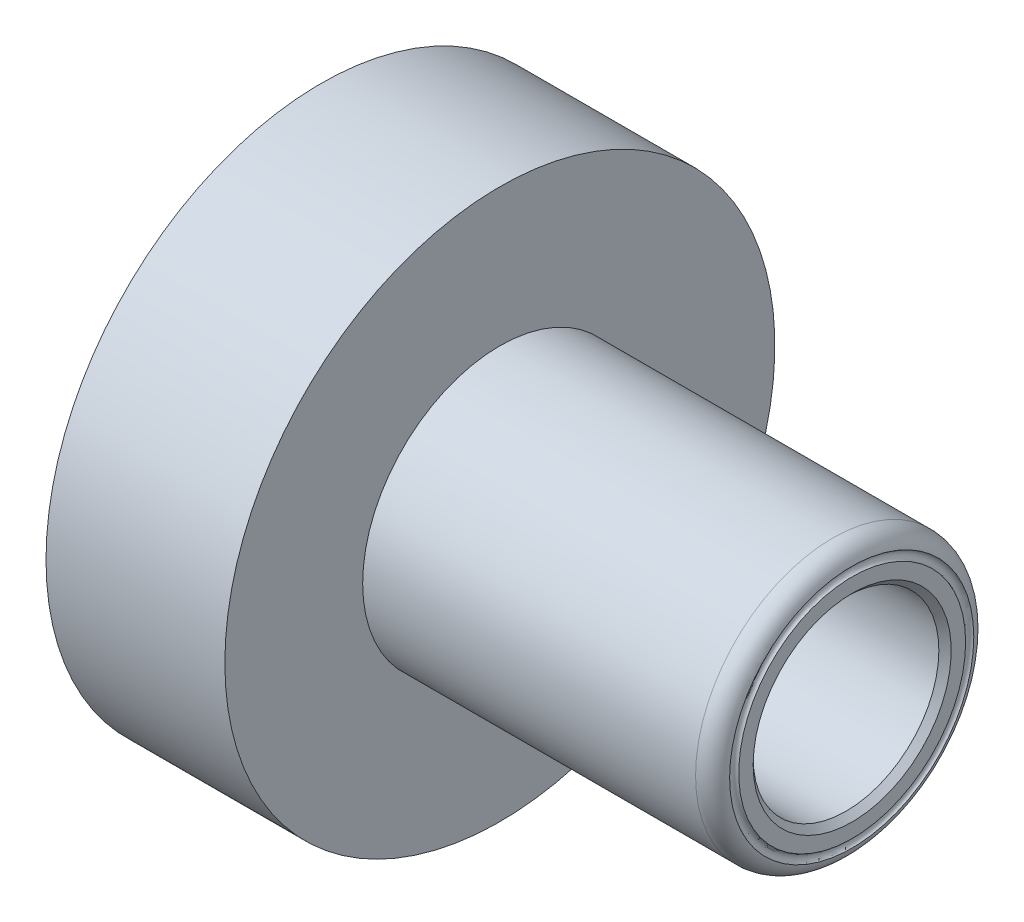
ISO-10303-21;
HEADER;
FILE_DESCRIPTION(('STEP AP214'),'2;1');
FILE_NAME('part.step','',(''),(''),'','','');
FILE_SCHEMA(('AUTOMOTIVE_DESIGN { 1 0 10303 214 1 1 1 1 }'));
ENDSEC;
DATA;
#1=APPLICATION_CONTEXT('core data for automotive mechanical design processes');
#2=APPLICATION_PROTOCOL_DEFINITION('international standard','automotive_design',2000,#1);
#3=PRODUCT_CONTEXT('',#1,'mechanical');
#4=PRODUCT('Part','Part','',(#3));
#5=PRODUCT_RELATED_PRODUCT_CATEGORY('part','',(#4));
#6=PRODUCT_DEFINITION_FORMATION('','',#4);
#7=PRODUCT_DEFINITION_CONTEXT('part definition',#1,'design');
#8=PRODUCT_DEFINITION('design','',#6,#7);
#9=PRODUCT_DEFINITION_SHAPE('','',#8);
#10=(LENGTH_UNIT() NAMED_UNIT(*) SI_UNIT(.MILLI.,.METRE.));
#11=(NAMED_UNIT(*) PLANE_ANGLE_UNIT() SI_UNIT($,.RADIAN.));
#12=(NAMED_UNIT(*) SI_UNIT($,.STERADIAN.) SOLID_ANGLE_UNIT());
#13=UNCERTAINTY_MEASURE_WITH_UNIT(LENGTH_MEASURE(1.E-05),#10,'distance_accuracy_value','');
#14=(GEOMETRIC_REPRESENTATION_CONTEXT(3) GLOBAL_UNCERTAINTY_ASSIGNED_CONTEXT((#13)) GLOBAL_UNIT_ASSIGNED_CONTEXT((#10,
#11,#12)) REPRESENTATION_CONTEXT('',''));
#15=CARTESIAN_POINT('',(0.,0.,0.));
#16=DIRECTION('',(0.,0.,1.));
#17=DIRECTION('',(1.,0.,0.));
#18=AXIS2_PLACEMENT_3D('',#15,#16,#17);
#19=CARTESIAN_POINT('',(42.926,9.5171,0.));
#20=DIRECTION('',(-1.,0.,0.));
#21=DIRECTION('',(0.,0.,1.));
#22=AXIS2_PLACEMENT_3D('',#19,#20,#21);
#23=PLANE('',#22);
#24=CARTESIAN_POINT('',(42.926,0.,0.));
#25=DIRECTION('',(-1.,0.,0.));
#26=DIRECTION('',(0.,0.,1.));
#27=AXIS2_PLACEMENT_3D('',#24,#25,#26);
#28=CIRCLE('',#27,8.005);
#29=CARTESIAN_POINT('',(42.926,0.,8.005));
#30=VERTEX_POINT('',#29);
#31=EDGE_CURVE('E10',#30,#30,#28,.T.);
#32=ORIENTED_EDGE('',*,*,#31,.T.);
#33=EDGE_LOOP('',(#32));
#34=FACE_BOUND('',#33,.T.);
#35=CARTESIAN_POINT('',(42.926,0.,0.));
#36=DIRECTION('',(1.,0.,0.));
#37=DIRECTION('',(0.,0.,-1.));
#38=AXIS2_PLACEMENT_3D('',#35,#36,#37);
#39=CIRCLE('',#38,9.16722912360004);
#40=CARTESIAN_POINT('',(42.926,0.,-9.16722912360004));
#41=VERTEX_POINT('',#40);
#42=EDGE_CURVE('E78',#41,#41,#39,.F.);
#43=ORIENTED_EDGE('',*,*,#42,.F.);
#44=EDGE_LOOP('',(#43));
#45=FACE_BOUND('',#44,.T.);
#46=ADVANCED_FACE('F31',(#34,#45),#23,.F.);
#47=CARTESIAN_POINT('',(41.356,0.,0.));
#48=DIRECTION('',(-1.,0.,0.));
#49=DIRECTION('',(0.,0.,1.));
#50=AXIS2_PLACEMENT_3D('',#47,#48,#49);
#51=TOROIDAL_SURFACE('',#50,9.5171,1.57);
#52=CARTESIAN_POINT('',(41.356,0.,0.));
#53=DIRECTION('',(-1.,0.,0.));
#54=DIRECTION('',(0.,0.,1.));
#55=AXIS2_PLACEMENT_3D('',#52,#53,#54);
#56=CIRCLE('',#55,11.0871);
#57=CARTESIAN_POINT('',(41.356,0.,11.0871));
#58=VERTEX_POINT('',#57);
#59=EDGE_CURVE('E48',#58,#58,#56,.T.);
#60=ORIENTED_EDGE('',*,*,#59,.F.);
#61=EDGE_LOOP('',(#60));
#62=FACE_BOUND('',#61,.T.);
#63=CARTESIAN_POINT('',(42.886773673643,0.,0.));
#64=DIRECTION('',(1.,0.,0.));
#65=DIRECTION('',(0.,0.,-1.));
#66=AXIS2_PLACEMENT_3D('',#63,#64,#65);
#67=CIRCLE('',#66,9.86585773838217);
#68=CARTESIAN_POINT('',(42.886773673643,0.,-9.86585773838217));
#69=VERTEX_POINT('',#68);
#70=EDGE_CURVE('E35',#69,#69,#67,.T.);
#71=ORIENTED_EDGE('',*,*,#70,.F.);
#72=EDGE_LOOP('',(#71));
#73=FACE_BOUND('',#72,.T.);
#74=ADVANCED_FACE('F87',(#62,#73),#51,.T.);
#75=CARTESIAN_POINT('',(0.,0.,0.));
#76=DIRECTION('',(-1.,0.,0.));
#77=DIRECTION('',(0.,0.,1.));
#78=AXIS2_PLACEMENT_3D('',#75,#76,#77);
#79=CYLINDRICAL_SURFACE('',#78,8.128);
#80=CARTESIAN_POINT('',(28.067,0.,0.));
#81=DIRECTION('',(-1.,0.,0.));
#82=DIRECTION('',(0.,0.,1.));
#83=AXIS2_PLACEMENT_3D('',#80,#81,#82);
#84=CIRCLE('',#83,8.128);
#85=CARTESIAN_POINT('',(28.067,0.,8.128));
#86=VERTEX_POINT('',#85);
#87=EDGE_CURVE('E43',#86,#86,#84,.T.);
#88=ORIENTED_EDGE('',*,*,#87,.F.);
#89=EDGE_LOOP('',(#88));
#90=FACE_BOUND('',#89,.T.);
#91=CARTESIAN_POINT('',(0.,0.,0.));
#92=DIRECTION('',(-1.,0.,0.));
#93=DIRECTION('',(0.,0.,1.));
#94=AXIS2_PLACEMENT_3D('',#91,#92,#93);
#95=CIRCLE('',#94,8.128);
#96=CARTESIAN_POINT('',(0.,0.,8.128));
#97=VERTEX_POINT('',#96);
#98=EDGE_CURVE('E60',#97,#97,#95,.T.);
#99=ORIENTED_EDGE('',*,*,#98,.T.);
#100=EDGE_LOOP('',(#99));
#101=FACE_BOUND('',#100,.T.);
#102=ADVANCED_FACE('F89',(#90,#101),#79,.F.);
#103=CARTESIAN_POINT('',(28.067,8.128,0.));
#104=DIRECTION('',(1.,0.,0.));
#105=DIRECTION('',(0.,0.,-1.));
#106=AXIS2_PLACEMENT_3D('',#103,#104,#105);
#107=PLANE('',#106);
#108=CARTESIAN_POINT('',(28.067,0.,0.));
#109=DIRECTION('',(1.,0.,0.));
#110=DIRECTION('',(0.,0.,-1.));
#111=AXIS2_PLACEMENT_3D('',#108,#109,#110);
#112=CIRCLE('',#111,7.505);
#113=CARTESIAN_POINT('',(28.067,0.,-7.505));
#114=VERTEX_POINT('',#113);
#115=EDGE_CURVE('E73',#114,#114,#112,.T.);
#116=ORIENTED_EDGE('',*,*,#115,.T.);
#117=EDGE_LOOP('',(#116));
#118=FACE_BOUND('',#117,.T.);
#119=ORIENTED_EDGE('',*,*,#87,.T.);
#120=EDGE_LOOP('',(#119));
#121=FACE_BOUND('',#120,.T.);
#122=ADVANCED_FACE('F96',(#118,#121),#107,.F.);
#123=CARTESIAN_POINT('',(0.,0.,0.));
#124=DIRECTION('',(-1.,0.,0.));
#125=DIRECTION('',(0.,0.,1.));
#126=AXIS2_PLACEMENT_3D('',#123,#124,#125);
#127=CYLINDRICAL_SURFACE('',#126,11.0871);
#128=CARTESIAN_POINT('',(14.4526,0.,0.));
#129=DIRECTION('',(-1.,0.,0.));
#130=DIRECTION('',(0.,0.,1.));
#131=AXIS2_PLACEMENT_3D('',#128,#129,#130);
#132=CIRCLE('',#131,11.0871);
#133=CARTESIAN_POINT('',(14.4526,0.,11.0871));
#134=VERTEX_POINT('',#133);
#135=EDGE_CURVE('E51',#134,#134,#132,.T.);
#136=ORIENTED_EDGE('',*,*,#135,.F.);
#137=EDGE_LOOP('',(#136));
#138=FACE_BOUND('',#137,.T.);
#139=ORIENTED_EDGE('',*,*,#59,.T.);
#140=EDGE_LOOP('',(#139));
#141=FACE_BOUND('',#140,.T.);
#142=ADVANCED_FACE('F101',(#138,#141),#127,.T.);
#143=CARTESIAN_POINT('',(14.4526,22.225,0.));
#144=DIRECTION('',(-1.,0.,0.));
#145=DIRECTION('',(0.,0.,1.));
#146=AXIS2_PLACEMENT_3D('',#143,#144,#145);
#147=PLANE('',#146);
#148=CARTESIAN_POINT('',(14.4526,0.,0.));
#149=DIRECTION('',(-1.,0.,0.));
#150=DIRECTION('',(0.,0.,1.));
#151=AXIS2_PLACEMENT_3D('',#148,#149,#150);
#152=CIRCLE('',#151,22.225);
#153=CARTESIAN_POINT('',(14.4526,0.,22.225));
#154=VERTEX_POINT('',#153);
#155=EDGE_CURVE('E54',#154,#154,#152,.T.);
#156=ORIENTED_EDGE('',*,*,#155,.F.);
#157=EDGE_LOOP('',(#156));
#158=FACE_BOUND('',#157,.T.);
#159=ORIENTED_EDGE('',*,*,#135,.T.);
#160=EDGE_LOOP('',(#159));
#161=FACE_BOUND('',#160,.T.);
#162=ADVANCED_FACE('F109',(#158,#161),#147,.F.);
#163=CARTESIAN_POINT('',(0.,0.,0.));
#164=DIRECTION('',(-1.,0.,0.));
#165=DIRECTION('',(0.,0.,1.));
#166=AXIS2_PLACEMENT_3D('',#163,#164,#165);
#167=CYLINDRICAL_SURFACE('',#166,22.225);
#168=CARTESIAN_POINT('',(0.,0.,0.));
#169=DIRECTION('',(-1.,0.,0.));
#170=DIRECTION('',(0.,0.,1.));
#171=AXIS2_PLACEMENT_3D('',#168,#169,#170);
#172=CIRCLE('',#171,22.225);
#173=CARTESIAN_POINT('',(0.,0.,22.225));
#174=VERTEX_POINT('',#173);
#175=EDGE_CURVE('E57',#174,#174,#172,.T.);
#176=ORIENTED_EDGE('',*,*,#175,.F.);
#177=EDGE_LOOP('',(#176));
#178=FACE_BOUND('',#177,.T.);
#179=ORIENTED_EDGE('',*,*,#155,.T.);
#180=EDGE_LOOP('',(#179));
#181=FACE_BOUND('',#180,.T.);
#182=ADVANCED_FACE('F121',(#178,#181),#167,.T.);
#183=CARTESIAN_POINT('',(0.,8.128,0.));
#184=DIRECTION('',(1.,0.,0.));
#185=DIRECTION('',(0.,0.,-1.));
#186=AXIS2_PLACEMENT_3D('',#183,#184,#185);
#187=PLANE('',#186);
#188=CARTESIAN_POINT('',(0.,0.,12.7));
#189=DIRECTION('',(-1.,0.,0.));
#190=DIRECTION('',(0.,0.,-1.));
#191=AXIS2_PLACEMENT_3D('',#188,#189,#190);
#192=CIRCLE('',#191,3.2004);
#193=CARTESIAN_POINT('',(0.,0.,9.4996));
#194=VERTEX_POINT('',#193);
#195=EDGE_CURVE('E70',#194,#194,#192,.T.);
#196=ORIENTED_EDGE('',*,*,#195,.F.);
#197=EDGE_LOOP('',(#196));
#198=FACE_BOUND('',#197,.T.);
#199=CARTESIAN_POINT('',(0.,0.,-12.7));
#200=DIRECTION('',(-1.,0.,0.));
#201=DIRECTION('',(0.,0.,1.));
#202=AXIS2_PLACEMENT_3D('',#199,#200,#201);
#203=CIRCLE('',#202,3.2004);
#204=CARTESIAN_POINT('',(0.,0.,-9.4996));
#205=VERTEX_POINT('',#204);
#206=EDGE_CURVE('E64',#205,#205,#203,.T.);
#207=ORIENTED_EDGE('',*,*,#206,.F.);
#208=EDGE_LOOP('',(#207));
#209=FACE_BOUND('',#208,.T.);
#210=ORIENTED_EDGE('',*,*,#98,.F.);
#211=EDGE_LOOP('',(#210));
#212=FACE_BOUND('',#211,.T.);
#213=ORIENTED_EDGE('',*,*,#175,.T.);
#214=EDGE_LOOP('',(#213));
#215=FACE_BOUND('',#214,.T.);
#216=ADVANCED_FACE('F117',(#198,#209,#212,#215),#187,.F.);
#217=CARTESIAN_POINT('',(7.9502,0.,-12.7));
#218=DIRECTION('',(-1.,0.,0.));
#219=DIRECTION('',(0.,0.,1.));
#220=AXIS2_PLACEMENT_3D('',#217,#218,#219);
#221=CYLINDRICAL_SURFACE('',#220,3.2004);
#222=CARTESIAN_POINT('',(7.9502,0.,-12.7));
#223=DIRECTION('',(-1.,0.,0.));
#224=DIRECTION('',(0.,0.,1.));
#225=AXIS2_PLACEMENT_3D('',#222,#223,#224);
#226=CIRCLE('',#225,3.2004);
#227=CARTESIAN_POINT('',(7.9502,0.,-9.4996));
#228=VERTEX_POINT('',#227);
#229=EDGE_CURVE('E63',#228,#228,#226,.T.);
#230=ORIENTED_EDGE('',*,*,#229,.F.);
#231=EDGE_LOOP('',(#230));
#232=FACE_BOUND('',#231,.T.);
#233=ORIENTED_EDGE('',*,*,#206,.T.);
#234=EDGE_LOOP('',(#233));
#235=FACE_BOUND('',#234,.T.);
#236=ADVANCED_FACE('F120',(#232,#235),#221,.F.);
#237=CARTESIAN_POINT('',(7.9502,0.,-12.7));
#238=DIRECTION('',(-1.,0.,0.));
#239=DIRECTION('',(0.,0.,1.));
#240=AXIS2_PLACEMENT_3D('',#237,#238,#239);
#241=PLANE('',#240);
#242=ORIENTED_EDGE('',*,*,#229,.T.);
#243=EDGE_LOOP('',(#242));
#244=FACE_BOUND('',#243,.T.);
#245=ADVANCED_FACE('F140',(#244),#241,.T.);
#246=CARTESIAN_POINT('',(7.9502,0.,12.7));
#247=DIRECTION('',(-1.,0.,0.));
#248=DIRECTION('',(0.,0.,1.));
#249=AXIS2_PLACEMENT_3D('',#246,#247,#248);
#250=CYLINDRICAL_SURFACE('',#249,3.2004);
#251=CARTESIAN_POINT('',(7.9502,0.,12.7));
#252=DIRECTION('',(-1.,0.,0.));
#253=DIRECTION('',(0.,0.,-1.));
#254=AXIS2_PLACEMENT_3D('',#251,#252,#253);
#255=CIRCLE('',#254,3.2004);
#256=CARTESIAN_POINT('',(7.9502,0.,9.4996));
#257=VERTEX_POINT('',#256);
#258=EDGE_CURVE('E67',#257,#257,#255,.T.);
#259=ORIENTED_EDGE('',*,*,#258,.F.);
#260=EDGE_LOOP('',(#259));
#261=FACE_BOUND('',#260,.T.);
#262=ORIENTED_EDGE('',*,*,#195,.T.);
#263=EDGE_LOOP('',(#262));
#264=FACE_BOUND('',#263,.T.);
#265=ADVANCED_FACE('F144',(#261,#264),#250,.F.);
#266=CARTESIAN_POINT('',(7.9502,0.,12.7));
#267=DIRECTION('',(1.,0.,0.));
#268=DIRECTION('',(0.,0.,-1.));
#269=AXIS2_PLACEMENT_3D('',#266,#267,#268);
#270=PLANE('',#269);
#271=ORIENTED_EDGE('',*,*,#258,.T.);
#272=EDGE_LOOP('',(#271));
#273=FACE_BOUND('',#272,.T.);
#274=ADVANCED_FACE('F148',(#273),#270,.F.);
#275=CARTESIAN_POINT('',(0.,0.,0.));
#276=DIRECTION('',(1.,0.,0.));
#277=DIRECTION('',(0.,0.,-1.));
#278=AXIS2_PLACEMENT_3D('',#275,#276,#277);
#279=CYLINDRICAL_SURFACE('',#278,7.505);
#280=CARTESIAN_POINT('',(42.426,0.,0.));
#281=DIRECTION('',(-1.,0.,0.));
#282=DIRECTION('',(0.,0.,1.));
#283=AXIS2_PLACEMENT_3D('',#280,#281,#282);
#284=CIRCLE('',#283,7.505);
#285=CARTESIAN_POINT('',(42.426,0.,7.505));
#286=VERTEX_POINT('',#285);
#287=EDGE_CURVE('E39',#286,#286,#284,.F.);
#288=ORIENTED_EDGE('',*,*,#287,.T.);
#289=EDGE_LOOP('',(#288));
#290=FACE_BOUND('',#289,.T.);
#291=ORIENTED_EDGE('',*,*,#115,.F.);
#292=EDGE_LOOP('',(#291));
#293=FACE_BOUND('',#292,.T.);
#294=ADVANCED_FACE('F152',(#290,#293),#279,.F.);
#295=CARTESIAN_POINT('',(42.426,0.,0.));
#296=DIRECTION('',(1.,0.,0.));
#297=DIRECTION('',(0.,0.,-1.));
#298=AXIS2_PLACEMENT_3D('',#295,#296,#297);
#299=CONICAL_SURFACE('',#298,7.505,0.785398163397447);
#300=ORIENTED_EDGE('',*,*,#31,.F.);
#301=EDGE_LOOP('',(#300));
#302=FACE_BOUND('',#301,.T.);
#303=ORIENTED_EDGE('',*,*,#287,.F.);
#304=EDGE_LOOP('',(#303));
#305=FACE_BOUND('',#304,.T.);
#306=ADVANCED_FACE('F33',(#302,#305),#299,.F.);
#307=CARTESIAN_POINT('',(43.057,0.,0.));
#308=DIRECTION('',(-1.,0.,0.));
#309=DIRECTION('',(0.,0.,1.));
#310=AXIS2_PLACEMENT_3D('',#307,#308,#309);
#311=TOROIDAL_SURFACE('',#310,9.525,0.381000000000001);
#312=ORIENTED_EDGE('',*,*,#70,.T.);
#313=EDGE_LOOP('',(#312));
#314=FACE_BOUND('',#313,.T.);
#315=ORIENTED_EDGE('',*,*,#42,.T.);
#316=EDGE_LOOP('',(#315));
#317=FACE_BOUND('',#316,.T.);
#318=ADVANCED_FACE('F85',(#314,#317),#311,.F.);
#319=CLOSED_SHELL('',(#46,#74,#102,#122,#142,#162,#182,#216,#236,#245,#265,#274,#294,#306,#318));
#320=MANIFOLD_SOLID_BREP('B2',#319);
#321=ADVANCED_BREP_SHAPE_REPRESENTATION('',(#18,#320),#14);
#322=SHAPE_DEFINITION_REPRESENTATION(#9,#321);
ENDSEC;
END-ISO-10303-21;
